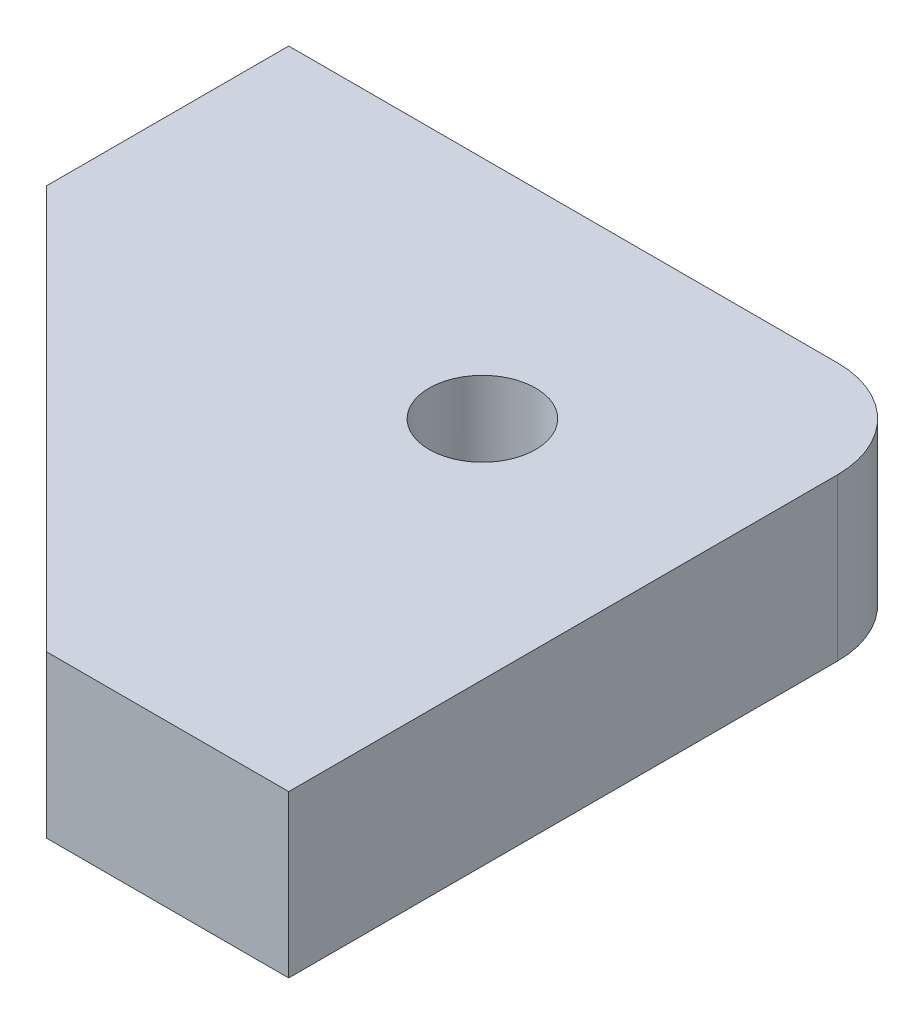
from build123d import *

# Parameters (mm, degrees)
BOSS_EXTRUDE1_DEPTH       = 2.5
M4X0_7_TAPPED_HOLE1_D     = 3.3
M4X0_7_TAPPED_HOLE1_DEPTH = 10.1
M4X0_7_TAPPED_HOLE1_TIP   = 0.991420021


with BuildPart() as part:
    # Sketch1 → Boss-Extrude1 (new, symmetric)
    with BuildSketch(Plane(origin=(0, 0, 0), x_dir=(1, 0, 0), z_dir=(0, 1, 0))):
        with BuildLine():
            Line((4, 7), (-13, 7))
            Line((-13, 7), (-13, -0.5))
            Line((-13, -0.5), (-0.5, -13))
            Line((-0.5, -13), (7, -13))
            Line((7, -13), (7, 4))
            ThreePointArc((7, 4), (6.121320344, 6.121320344), (4, 7))
        make_face()
    extrude(amount=BOSS_EXTRUDE1_DEPTH, both=True)

    # M4x0.7 Tapped Hole1
    with Locations(Plane(origin=(0, 2.5, 0), x_dir=(1, 0, 0), z_dir=(0, 1, 0))):
        with Locations((0, 0)):
            Hole(M4X0_7_TAPPED_HOLE1_D / 2, depth=M4X0_7_TAPPED_HOLE1_DEPTH)
            with Locations((0, 0, -(M4X0_7_TAPPED_HOLE1_DEPTH + M4X0_7_TAPPED_HOLE1_TIP / 2))):  # 118° drill point
                Cone(0, M4X0_7_TAPPED_HOLE1_D / 2, M4X0_7_TAPPED_HOLE1_TIP, mode=Mode.SUBTRACT)


solid = part.part
